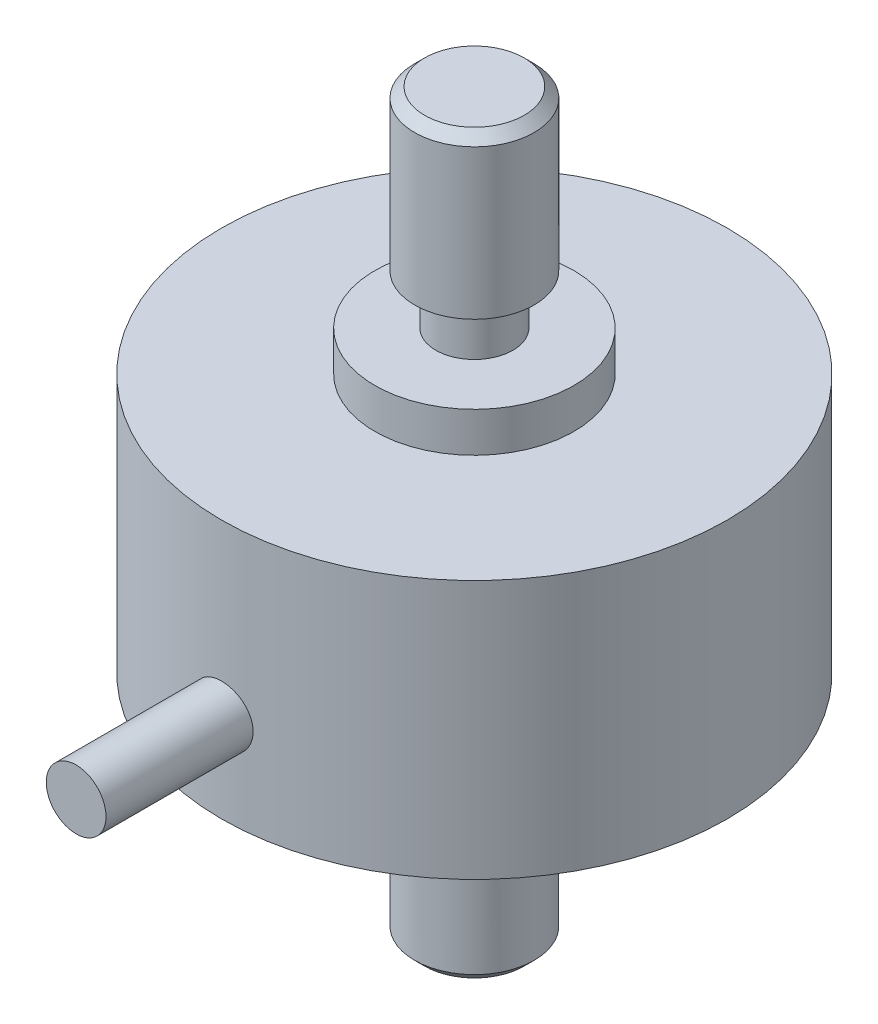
ISO-10303-21;
HEADER;
FILE_DESCRIPTION(('STEP AP214'),'2;1');
FILE_NAME('part.step','',(''),(''),'','','');
FILE_SCHEMA(('AUTOMOTIVE_DESIGN { 1 0 10303 214 1 1 1 1 }'));
ENDSEC;
DATA;
#1=APPLICATION_CONTEXT('core data for automotive mechanical design processes');
#2=APPLICATION_PROTOCOL_DEFINITION('international standard','automotive_design',2000,#1);
#3=PRODUCT_CONTEXT('',#1,'mechanical');
#4=PRODUCT('Part','Part','',(#3));
#5=PRODUCT_RELATED_PRODUCT_CATEGORY('part','',(#4));
#6=PRODUCT_DEFINITION_FORMATION('','',#4);
#7=PRODUCT_DEFINITION_CONTEXT('part definition',#1,'design');
#8=PRODUCT_DEFINITION('design','',#6,#7);
#9=PRODUCT_DEFINITION_SHAPE('','',#8);
#10=(LENGTH_UNIT() NAMED_UNIT(*) SI_UNIT(.MILLI.,.METRE.));
#11=(NAMED_UNIT(*) PLANE_ANGLE_UNIT() SI_UNIT($,.RADIAN.));
#12=(NAMED_UNIT(*) SI_UNIT($,.STERADIAN.) SOLID_ANGLE_UNIT());
#13=UNCERTAINTY_MEASURE_WITH_UNIT(LENGTH_MEASURE(1.E-05),#10,'distance_accuracy_value','');
#14=(GEOMETRIC_REPRESENTATION_CONTEXT(3) GLOBAL_UNCERTAINTY_ASSIGNED_CONTEXT((#13)) GLOBAL_UNIT_ASSIGNED_CONTEXT((#10,
#11,#12)) REPRESENTATION_CONTEXT('',''));
#15=CARTESIAN_POINT('',(0.,0.,0.));
#16=DIRECTION('',(0.,0.,1.));
#17=DIRECTION('',(1.,0.,0.));
#18=AXIS2_PLACEMENT_3D('',#15,#16,#17);
#19=CARTESIAN_POINT('',(0.,0.,0.));
#20=DIRECTION('',(0.,-1.,0.));
#21=DIRECTION('',(0.,0.,-1.));
#22=AXIS2_PLACEMENT_3D('',#19,#20,#21);
#23=CYLINDRICAL_SURFACE('',#22,12.7);
#24=CARTESIAN_POINT('',(0.,11.5,0.));
#25=DIRECTION('',(0.,-1.,0.));
#26=DIRECTION('',(0.,0.,-1.));
#27=AXIS2_PLACEMENT_3D('',#24,#25,#26);
#28=CIRCLE('',#27,12.7);
#29=CARTESIAN_POINT('',(0.,11.5,-12.7));
#30=VERTEX_POINT('',#29);
#31=EDGE_CURVE('E130',#30,#30,#28,.T.);
#32=ORIENTED_EDGE('',*,*,#31,.F.);
#33=EDGE_LOOP('',(#32));
#34=FACE_BOUND('',#33,.T.);
#35=CARTESIAN_POINT('',(0.,24.5,0.));
#36=DIRECTION('',(0.,-1.,0.));
#37=DIRECTION('',(0.,0.,-1.));
#38=AXIS2_PLACEMENT_3D('',#35,#36,#37);
#39=CIRCLE('',#38,12.7);
#40=CARTESIAN_POINT('',(0.,24.5,-12.7));
#41=VERTEX_POINT('',#40);
#42=EDGE_CURVE('E134',#41,#41,#39,.T.);
#43=ORIENTED_EDGE('',*,*,#42,.T.);
#44=EDGE_LOOP('',(#43));
#45=FACE_BOUND('',#44,.T.);
#46=CARTESIAN_POINT('',(-1.5,16.,12.6111062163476));
#47=CARTESIAN_POINT('',(-1.49999640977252,15.916060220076,12.6111073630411));
#48=CARTESIAN_POINT('',(-1.49293035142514,15.8320670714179,12.6119533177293));
#49=CARTESIAN_POINT('',(-1.46485268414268,15.6664156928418,12.6152446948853));
#50=CARTESIAN_POINT('',(-1.44382626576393,15.5847600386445,12.617691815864));
#51=CARTESIAN_POINT('',(-1.38845410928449,15.4262061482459,12.6239045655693));
#52=CARTESIAN_POINT('',(-1.35411712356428,15.3493048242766,12.6276693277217));
#53=CARTESIAN_POINT('',(-1.27311672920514,15.2023712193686,12.6360921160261));
#54=CARTESIAN_POINT('',(-1.22645552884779,15.1323377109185,12.6407499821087));
#55=CARTESIAN_POINT('',(-1.12188053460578,15.0007616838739,12.6504603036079));
#56=CARTESIAN_POINT('',(-1.06391734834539,14.9392585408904,12.6555144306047));
#57=CARTESIAN_POINT('',(-0.938489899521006,14.8268289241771,12.6654327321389));
#58=CARTESIAN_POINT('',(-0.871025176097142,14.7759029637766,12.6702968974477));
#59=CARTESIAN_POINT('',(-0.728263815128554,14.6859333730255,12.6793041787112));
#60=CARTESIAN_POINT('',(-0.652944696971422,14.6469251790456,12.683445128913));
#61=CARTESIAN_POINT('',(-0.496767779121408,14.5821253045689,12.6905210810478));
#62=CARTESIAN_POINT('',(-0.415910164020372,14.556333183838,12.6934561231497));
#63=CARTESIAN_POINT('',(-0.251353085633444,14.518814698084,12.6977777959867));
#64=CARTESIAN_POINT('',(-0.167668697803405,14.5070230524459,12.6991716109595));
#65=CARTESIAN_POINT('',(0.000501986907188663,14.4976380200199,12.7002782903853));
#66=CARTESIAN_POINT('',(0.084988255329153,14.5000441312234,12.6999912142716));
#67=CARTESIAN_POINT('',(0.251920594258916,14.5189337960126,12.6977742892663));
#68=CARTESIAN_POINT('',(0.334374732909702,14.5353471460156,12.6958526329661));
#69=CARTESIAN_POINT('',(0.495349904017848,14.5816757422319,12.6905917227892));
#70=CARTESIAN_POINT('',(0.573870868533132,14.6115912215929,12.6872524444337));
#71=CARTESIAN_POINT('',(0.724969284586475,14.6841502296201,12.6795174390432));
#72=CARTESIAN_POINT('',(0.797531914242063,14.7268243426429,12.6751191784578));
#73=CARTESIAN_POINT('',(0.934492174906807,14.8236670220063,12.6657587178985));
#74=CARTESIAN_POINT('',(0.99888947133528,14.8778360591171,12.6607964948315));
#75=CARTESIAN_POINT('',(1.11810314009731,14.9965246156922,12.6508281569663));
#76=CARTESIAN_POINT('',(1.17285864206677,15.0611052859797,12.6458219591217));
#77=CARTESIAN_POINT('',(1.27076187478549,15.1985732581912,12.6363598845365));
#78=CARTESIAN_POINT('',(1.31390957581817,15.2714605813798,12.6319040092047));
#79=CARTESIAN_POINT('',(1.38737475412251,15.423524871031,12.6240470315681));
#80=CARTESIAN_POINT('',(1.41768768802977,15.5027040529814,12.620646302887));
#81=CARTESIAN_POINT('',(1.46457061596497,15.6650777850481,12.6152921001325));
#82=CARTESIAN_POINT('',(1.48114119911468,15.7482721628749,12.6133385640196));
#83=CARTESIAN_POINT('',(1.49998912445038,15.915778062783,12.6111111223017));
#84=CARTESIAN_POINT('',(1.50235197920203,16.0000798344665,12.6108271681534));
#85=CARTESIAN_POINT('',(1.49294268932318,16.1678780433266,12.611944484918));
#86=CARTESIAN_POINT('',(1.48117081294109,16.2513744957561,12.6133457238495));
#87=CARTESIAN_POINT('',(1.44389808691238,16.4149377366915,12.6176663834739));
#88=CARTESIAN_POINT('',(1.4184383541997,16.4950140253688,12.6205812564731));
#89=CARTESIAN_POINT('',(1.35455484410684,16.6497605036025,12.6275970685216));
#90=CARTESIAN_POINT('',(1.31613065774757,16.7244305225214,12.6316980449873));
#91=CARTESIAN_POINT('',(1.22719753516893,16.8666325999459,12.640648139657));
#92=CARTESIAN_POINT('',(1.17663234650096,16.9341292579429,12.6455007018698));
#93=CARTESIAN_POINT('',(1.06493242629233,17.0597080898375,12.6553962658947));
#94=CARTESIAN_POINT('',(1.00379732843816,17.1177899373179,12.6604392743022));
#95=CARTESIAN_POINT('',(0.872320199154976,17.2231891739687,12.670178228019));
#96=CARTESIAN_POINT('',(0.801933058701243,17.2704504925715,12.6748722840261));
#97=CARTESIAN_POINT('',(0.654170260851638,17.3524797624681,12.6833564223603));
#98=CARTESIAN_POINT('',(0.576794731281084,17.3872479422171,12.6871465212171));
#99=CARTESIAN_POINT('',(0.417440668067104,17.4432106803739,12.6933872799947));
#100=CARTESIAN_POINT('',(0.335473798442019,17.4644380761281,12.6958411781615));
#101=CARTESIAN_POINT('',(0.169108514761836,17.4928236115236,12.6991464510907));
#102=CARTESIAN_POINT('',(0.0847101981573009,17.4999823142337,12.6999978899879));
#103=CARTESIAN_POINT('',(-0.0835737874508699,17.5000175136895,12.7000020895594));
#104=CARTESIAN_POINT('',(-0.16745945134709,17.4929806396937,12.6991651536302));
#105=CARTESIAN_POINT('',(-0.332847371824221,17.4650073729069,12.6959070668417));
#106=CARTESIAN_POINT('',(-0.414349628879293,17.444070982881,12.6934859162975));
#107=CARTESIAN_POINT('',(-0.572648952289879,17.3889192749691,12.6873303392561));
#108=CARTESIAN_POINT('',(-0.649447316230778,17.3547076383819,12.6835962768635));
#109=CARTESIAN_POINT('',(-0.796226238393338,17.273985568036,12.6752291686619));
#110=CARTESIAN_POINT('',(-0.866206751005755,17.2274750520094,12.6705961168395));
#111=CARTESIAN_POINT('',(-0.997806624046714,17.1231534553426,12.6609149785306));
#112=CARTESIAN_POINT('',(-1.05937467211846,17.0652778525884,12.6558646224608));
#113=CARTESIAN_POINT('',(-1.17195987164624,16.9400017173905,12.645936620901));
#114=CARTESIAN_POINT('',(-1.22297451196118,16.8725989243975,12.6410590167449));
#115=CARTESIAN_POINT('',(-1.3131529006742,16.7299171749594,12.6320107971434));
#116=CARTESIAN_POINT('',(-1.35227506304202,16.6546117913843,12.6278426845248));
#117=CARTESIAN_POINT('',(-1.41726371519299,16.4984948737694,12.620714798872));
#118=CARTESIAN_POINT('',(-1.44314478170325,16.4176895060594,12.6177536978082));
#119=CARTESIAN_POINT('',(-1.47464317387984,16.2803781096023,12.614102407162));
#120=CARTESIAN_POINT('',(-1.48413851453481,16.2247419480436,12.6129843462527));
#121=CARTESIAN_POINT('',(-1.4968181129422,16.1127452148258,12.6114858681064));
#122=CARTESIAN_POINT('',(-1.50000241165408,16.0563846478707,12.6111054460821));
#123=CARTESIAN_POINT('',(-1.5,16.,12.6111062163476));
#124=B_SPLINE_CURVE_WITH_KNOTS('',3,(#46,#47,#48,#49,#50,#51,#52,#53,#54,#55,#56,#57,#58,#59,
#60,#61,#62,#63,#64,#65,#66,#67,#68,#69,#70,#71,#72,#73,#74,#75,#76,#77,#78,#79,#80,#81,#82,#83,
#84,#85,#86,#87,#88,#89,#90,#91,#92,#93,#94,#95,#96,#97,#98,#99,#100,#101,#102,#103,#104,#105,
#106,#107,#108,#109,#110,#111,#112,#113,#114,#115,#116,#117,#118,#119,#120,#121,#122,#123),
.UNSPECIFIED.,.T.,.F.,(4,2,2,2,2,2,2,2,2,2,2,2,2,2,2,2,2,2,2,2,2,2,2,2,2,2,2,2,2,2,2,2,2,2,2,2,
2,2,4),(0.,0.251613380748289,0.503494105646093,0.75520948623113,1.00687979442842,
1.25967566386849,1.51248379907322,1.76603647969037,2.0195807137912,2.27193803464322,
2.52428643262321,2.77537745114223,3.02647280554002,3.27817496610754,3.5298874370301,
3.78313609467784,4.03638540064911,4.28972427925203,4.5430522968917,4.79485406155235,
5.04665104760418,5.29769585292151,5.54874857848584,5.80098773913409,6.05323564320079,
6.30676248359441,6.56028468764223,6.8131897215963,7.06608463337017,7.31744090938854,
7.56879713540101,7.82008370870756,8.07137196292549,8.32413038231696,8.57694887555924,
8.83064152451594,9.08405428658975,9.25307097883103,9.42208657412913),.UNSPECIFIED.);
#125=CARTESIAN_POINT('',(-1.5,16.,12.6111062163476));
#126=VERTEX_POINT('',#125);
#127=EDGE_CURVE('E61',#126,#126,#124,.T.);
#128=ORIENTED_EDGE('',*,*,#127,.F.);
#129=EDGE_LOOP('',(#128));
#130=FACE_BOUND('',#129,.T.);
#131=ADVANCED_FACE('F41',(#34,#45,#130),#23,.T.);
#132=CARTESIAN_POINT('',(0.,37.,0.));
#133=DIRECTION('',(0.,-1.,0.));
#134=DIRECTION('',(0.,0.,-1.));
#135=AXIS2_PLACEMENT_3D('',#132,#133,#134);
#136=PLANE('',#135);
#137=CARTESIAN_POINT('',(0.,37.,0.));
#138=DIRECTION('',(0.,-1.,0.));
#139=DIRECTION('',(0.,0.,-1.));
#140=AXIS2_PLACEMENT_3D('',#137,#138,#139);
#141=CIRCLE('',#140,2.5);
#142=CARTESIAN_POINT('',(0.,37.,-2.5));
#143=VERTEX_POINT('',#142);
#144=EDGE_CURVE('E10',#143,#143,#141,.F.);
#145=ORIENTED_EDGE('',*,*,#144,.T.);
#146=EDGE_LOOP('',(#145));
#147=FACE_BOUND('',#146,.T.);
#148=ADVANCED_FACE('F116',(#147),#136,.F.);
#149=CARTESIAN_POINT('',(0.,0.,0.));
#150=DIRECTION('',(0.,-1.,0.));
#151=DIRECTION('',(0.,0.,-1.));
#152=AXIS2_PLACEMENT_3D('',#149,#150,#151);
#153=CYLINDRICAL_SURFACE('',#152,3.);
#154=CARTESIAN_POINT('',(0.,36.5,0.));
#155=DIRECTION('',(0.,-1.,0.));
#156=DIRECTION('',(0.,0.,-1.));
#157=AXIS2_PLACEMENT_3D('',#154,#155,#156);
#158=CIRCLE('',#157,3.);
#159=CARTESIAN_POINT('',(0.,36.5,-3.));
#160=VERTEX_POINT('',#159);
#161=EDGE_CURVE('E47',#160,#160,#158,.T.);
#162=ORIENTED_EDGE('',*,*,#161,.T.);
#163=EDGE_LOOP('',(#162));
#164=FACE_BOUND('',#163,.T.);
#165=CARTESIAN_POINT('',(0.,29.,0.));
#166=DIRECTION('',(0.,-1.,0.));
#167=DIRECTION('',(0.,0.,-1.));
#168=AXIS2_PLACEMENT_3D('',#165,#166,#167);
#169=CIRCLE('',#168,3.);
#170=CARTESIAN_POINT('',(0.,29.,-3.));
#171=VERTEX_POINT('',#170);
#172=EDGE_CURVE('E69',#171,#171,#169,.T.);
#173=ORIENTED_EDGE('',*,*,#172,.F.);
#174=EDGE_LOOP('',(#173));
#175=FACE_BOUND('',#174,.T.);
#176=ADVANCED_FACE('F125',(#164,#175),#153,.T.);
#177=CARTESIAN_POINT('',(-3.,29.,0.));
#178=DIRECTION('',(0.,1.,0.));
#179=DIRECTION('',(0.,0.,1.));
#180=AXIS2_PLACEMENT_3D('',#177,#178,#179);
#181=PLANE('',#180);
#182=CARTESIAN_POINT('',(0.,29.,0.));
#183=DIRECTION('',(0.,-1.,0.));
#184=DIRECTION('',(0.,0.,-1.));
#185=AXIS2_PLACEMENT_3D('',#182,#183,#184);
#186=CIRCLE('',#185,1.93637753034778);
#187=CARTESIAN_POINT('',(0.,29.,-1.93637753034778));
#188=VERTEX_POINT('',#187);
#189=EDGE_CURVE('E150',#188,#188,#186,.T.);
#190=ORIENTED_EDGE('',*,*,#189,.F.);
#191=EDGE_LOOP('',(#190));
#192=FACE_BOUND('',#191,.T.);
#193=ORIENTED_EDGE('',*,*,#172,.T.);
#194=EDGE_LOOP('',(#193));
#195=FACE_BOUND('',#194,.T.);
#196=ADVANCED_FACE('F152',(#192,#195),#181,.F.);
#197=CARTESIAN_POINT('',(0.,0.,0.));
#198=DIRECTION('',(0.,-1.,0.));
#199=DIRECTION('',(0.,0.,-1.));
#200=AXIS2_PLACEMENT_3D('',#197,#198,#199);
#201=CYLINDRICAL_SURFACE('',#200,1.93637753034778);
#202=CARTESIAN_POINT('',(0.,26.5,0.));
#203=DIRECTION('',(0.,-1.,0.));
#204=DIRECTION('',(0.,0.,-1.));
#205=AXIS2_PLACEMENT_3D('',#202,#203,#204);
#206=CIRCLE('',#205,1.93637753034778);
#207=CARTESIAN_POINT('',(0.,26.5,-1.93637753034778));
#208=VERTEX_POINT('',#207);
#209=EDGE_CURVE('E144',#208,#208,#206,.T.);
#210=ORIENTED_EDGE('',*,*,#209,.F.);
#211=EDGE_LOOP('',(#210));
#212=FACE_BOUND('',#211,.T.);
#213=ORIENTED_EDGE('',*,*,#189,.T.);
#214=EDGE_LOOP('',(#213));
#215=FACE_BOUND('',#214,.T.);
#216=ADVANCED_FACE('F161',(#212,#215),#201,.T.);
#217=CARTESIAN_POINT('',(-1.93637753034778,26.5,0.));
#218=DIRECTION('',(0.,-1.,0.));
#219=DIRECTION('',(0.,0.,-1.));
#220=AXIS2_PLACEMENT_3D('',#217,#218,#219);
#221=PLANE('',#220);
#222=CARTESIAN_POINT('',(0.,26.5,0.));
#223=DIRECTION('',(0.,-1.,0.));
#224=DIRECTION('',(0.,0.,-1.));
#225=AXIS2_PLACEMENT_3D('',#222,#223,#224);
#226=CIRCLE('',#225,5.);
#227=CARTESIAN_POINT('',(0.,26.5,-5.));
#228=VERTEX_POINT('',#227);
#229=EDGE_CURVE('E140',#228,#228,#226,.T.);
#230=ORIENTED_EDGE('',*,*,#229,.F.);
#231=EDGE_LOOP('',(#230));
#232=FACE_BOUND('',#231,.T.);
#233=ORIENTED_EDGE('',*,*,#209,.T.);
#234=EDGE_LOOP('',(#233));
#235=FACE_BOUND('',#234,.T.);
#236=ADVANCED_FACE('F234',(#232,#235),#221,.F.);
#237=CARTESIAN_POINT('',(0.,0.,0.));
#238=DIRECTION('',(0.,-1.,0.));
#239=DIRECTION('',(0.,0.,-1.));
#240=AXIS2_PLACEMENT_3D('',#237,#238,#239);
#241=CYLINDRICAL_SURFACE('',#240,5.);
#242=CARTESIAN_POINT('',(0.,24.5,0.));
#243=DIRECTION('',(0.,-1.,0.));
#244=DIRECTION('',(0.,0.,-1.));
#245=AXIS2_PLACEMENT_3D('',#242,#243,#244);
#246=CIRCLE('',#245,5.);
#247=CARTESIAN_POINT('',(0.,24.5,-5.));
#248=VERTEX_POINT('',#247);
#249=EDGE_CURVE('E133',#248,#248,#246,.T.);
#250=ORIENTED_EDGE('',*,*,#249,.F.);
#251=EDGE_LOOP('',(#250));
#252=FACE_BOUND('',#251,.T.);
#253=ORIENTED_EDGE('',*,*,#229,.T.);
#254=EDGE_LOOP('',(#253));
#255=FACE_BOUND('',#254,.T.);
#256=ADVANCED_FACE('F115',(#252,#255),#241,.T.);
#257=CARTESIAN_POINT('',(-5.,24.5,0.));
#258=DIRECTION('',(0.,-1.,0.));
#259=DIRECTION('',(0.,0.,-1.));
#260=AXIS2_PLACEMENT_3D('',#257,#258,#259);
#261=PLANE('',#260);
#262=ORIENTED_EDGE('',*,*,#42,.F.);
#263=EDGE_LOOP('',(#262));
#264=FACE_BOUND('',#263,.T.);
#265=ORIENTED_EDGE('',*,*,#249,.T.);
#266=EDGE_LOOP('',(#265));
#267=FACE_BOUND('',#266,.T.);
#268=ADVANCED_FACE('F110',(#264,#267),#261,.F.);
#269=CARTESIAN_POINT('',(-12.7,11.5,0.));
#270=DIRECTION('',(0.,1.,0.));
#271=DIRECTION('',(0.,0.,1.));
#272=AXIS2_PLACEMENT_3D('',#269,#270,#271);
#273=PLANE('',#272);
#274=CARTESIAN_POINT('',(0.,11.5,0.));
#275=DIRECTION('',(0.,-1.,0.));
#276=DIRECTION('',(0.,0.,-1.));
#277=AXIS2_PLACEMENT_3D('',#274,#275,#276);
#278=CIRCLE('',#277,3.3);
#279=CARTESIAN_POINT('',(0.,11.5,-3.3));
#280=VERTEX_POINT('',#279);
#281=EDGE_CURVE('E137',#280,#280,#278,.T.);
#282=ORIENTED_EDGE('',*,*,#281,.F.);
#283=EDGE_LOOP('',(#282));
#284=FACE_BOUND('',#283,.T.);
#285=ORIENTED_EDGE('',*,*,#31,.T.);
#286=EDGE_LOOP('',(#285));
#287=FACE_BOUND('',#286,.T.);
#288=ADVANCED_FACE('F102',(#284,#287),#273,.F.);
#289=CARTESIAN_POINT('',(0.,0.,0.));
#290=DIRECTION('',(0.,-1.,0.));
#291=DIRECTION('',(0.,0.,-1.));
#292=AXIS2_PLACEMENT_3D('',#289,#290,#291);
#293=CYLINDRICAL_SURFACE('',#292,3.3);
#294=CARTESIAN_POINT('',(0.,10.5,0.));
#295=DIRECTION('',(0.,-1.,0.));
#296=DIRECTION('',(0.,0.,-1.));
#297=AXIS2_PLACEMENT_3D('',#294,#295,#296);
#298=CIRCLE('',#297,3.3);
#299=CARTESIAN_POINT('',(0.,10.5,-3.3));
#300=VERTEX_POINT('',#299);
#301=EDGE_CURVE('E194',#300,#300,#298,.T.);
#302=ORIENTED_EDGE('',*,*,#301,.F.);
#303=EDGE_LOOP('',(#302));
#304=FACE_BOUND('',#303,.T.);
#305=ORIENTED_EDGE('',*,*,#281,.T.);
#306=EDGE_LOOP('',(#305));
#307=FACE_BOUND('',#306,.T.);
#308=ADVANCED_FACE('F101',(#304,#307),#293,.T.);
#309=CARTESIAN_POINT('',(-3.3,10.5,0.));
#310=DIRECTION('',(0.,1.,0.));
#311=DIRECTION('',(0.,0.,1.));
#312=AXIS2_PLACEMENT_3D('',#309,#310,#311);
#313=PLANE('',#312);
#314=CARTESIAN_POINT('',(0.,10.5,0.));
#315=DIRECTION('',(0.,-1.,0.));
#316=DIRECTION('',(0.,0.,-1.));
#317=AXIS2_PLACEMENT_3D('',#314,#315,#316);
#318=CIRCLE('',#317,2.3092706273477);
#319=CARTESIAN_POINT('',(0.,10.5,-2.3092706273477));
#320=VERTEX_POINT('',#319);
#321=EDGE_CURVE('E190',#320,#320,#318,.T.);
#322=ORIENTED_EDGE('',*,*,#321,.F.);
#323=EDGE_LOOP('',(#322));
#324=FACE_BOUND('',#323,.T.);
#325=ORIENTED_EDGE('',*,*,#301,.T.);
#326=EDGE_LOOP('',(#325));
#327=FACE_BOUND('',#326,.T.);
#328=ADVANCED_FACE('F100',(#324,#327),#313,.F.);
#329=CARTESIAN_POINT('',(0.,0.,0.));
#330=DIRECTION('',(0.,-1.,0.));
#331=DIRECTION('',(0.,0.,-1.));
#332=AXIS2_PLACEMENT_3D('',#329,#330,#331);
#333=CYLINDRICAL_SURFACE('',#332,2.3092706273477);
#334=CARTESIAN_POINT('',(0.,8.,0.));
#335=DIRECTION('',(0.,-1.,0.));
#336=DIRECTION('',(0.,0.,-1.));
#337=AXIS2_PLACEMENT_3D('',#334,#335,#336);
#338=CIRCLE('',#337,2.3092706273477);
#339=CARTESIAN_POINT('',(0.,8.,-2.3092706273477));
#340=VERTEX_POINT('',#339);
#341=EDGE_CURVE('E184',#340,#340,#338,.T.);
#342=ORIENTED_EDGE('',*,*,#341,.F.);
#343=EDGE_LOOP('',(#342));
#344=FACE_BOUND('',#343,.T.);
#345=ORIENTED_EDGE('',*,*,#321,.T.);
#346=EDGE_LOOP('',(#345));
#347=FACE_BOUND('',#346,.T.);
#348=ADVANCED_FACE('F91',(#344,#347),#333,.T.);
#349=CARTESIAN_POINT('',(-2.3092706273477,8.,0.));
#350=DIRECTION('',(0.,-1.,0.));
#351=DIRECTION('',(0.,0.,-1.));
#352=AXIS2_PLACEMENT_3D('',#349,#350,#351);
#353=PLANE('',#352);
#354=CARTESIAN_POINT('',(0.,8.,0.));
#355=DIRECTION('',(0.,-1.,0.));
#356=DIRECTION('',(0.,0.,-1.));
#357=AXIS2_PLACEMENT_3D('',#354,#355,#356);
#358=CIRCLE('',#357,3.);
#359=CARTESIAN_POINT('',(0.,8.,-3.));
#360=VERTEX_POINT('',#359);
#361=EDGE_CURVE('E181',#360,#360,#358,.T.);
#362=ORIENTED_EDGE('',*,*,#361,.F.);
#363=EDGE_LOOP('',(#362));
#364=FACE_BOUND('',#363,.T.);
#365=ORIENTED_EDGE('',*,*,#341,.T.);
#366=EDGE_LOOP('',(#365));
#367=FACE_BOUND('',#366,.T.);
#368=ADVANCED_FACE('F90',(#364,#367),#353,.F.);
#369=CARTESIAN_POINT('',(0.,0.,0.));
#370=DIRECTION('',(0.,-1.,0.));
#371=DIRECTION('',(0.,0.,-1.));
#372=AXIS2_PLACEMENT_3D('',#369,#370,#371);
#373=CYLINDRICAL_SURFACE('',#372,3.);
#374=CARTESIAN_POINT('',(0.,0.500000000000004,0.));
#375=DIRECTION('',(0.,1.,0.));
#376=DIRECTION('',(0.,0.,1.));
#377=AXIS2_PLACEMENT_3D('',#374,#375,#376);
#378=CIRCLE('',#377,3.);
#379=CARTESIAN_POINT('',(0.,0.500000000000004,3.));
#380=VERTEX_POINT('',#379);
#381=EDGE_CURVE('E52',#380,#380,#378,.T.);
#382=ORIENTED_EDGE('',*,*,#381,.T.);
#383=EDGE_LOOP('',(#382));
#384=FACE_BOUND('',#383,.T.);
#385=ORIENTED_EDGE('',*,*,#361,.T.);
#386=EDGE_LOOP('',(#385));
#387=FACE_BOUND('',#386,.T.);
#388=ADVANCED_FACE('F84',(#384,#387),#373,.T.);
#389=CARTESIAN_POINT('',(-3.,0.,0.));
#390=DIRECTION('',(0.,1.,0.));
#391=DIRECTION('',(0.,0.,1.));
#392=AXIS2_PLACEMENT_3D('',#389,#390,#391);
#393=PLANE('',#392);
#394=CARTESIAN_POINT('',(0.,0.,0.));
#395=DIRECTION('',(0.,1.,0.));
#396=DIRECTION('',(0.,0.,1.));
#397=AXIS2_PLACEMENT_3D('',#394,#395,#396);
#398=CIRCLE('',#397,2.5);
#399=CARTESIAN_POINT('',(0.,0.,2.5));
#400=VERTEX_POINT('',#399);
#401=EDGE_CURVE('E60',#400,#400,#398,.F.);
#402=ORIENTED_EDGE('',*,*,#401,.T.);
#403=EDGE_LOOP('',(#402));
#404=FACE_BOUND('',#403,.T.);
#405=ADVANCED_FACE('F81',(#404),#393,.F.);
#406=CARTESIAN_POINT('',(0.,16.,20.));
#407=DIRECTION('',(0.,0.,-1.));
#408=DIRECTION('',(-1.,0.,0.));
#409=AXIS2_PLACEMENT_3D('',#406,#407,#408);
#410=CYLINDRICAL_SURFACE('',#409,1.5);
#411=CARTESIAN_POINT('',(0.,16.,20.));
#412=DIRECTION('',(0.,0.,1.));
#413=DIRECTION('',(1.,0.,0.));
#414=AXIS2_PLACEMENT_3D('',#411,#412,#413);
#415=CIRCLE('',#414,1.5);
#416=CARTESIAN_POINT('',(1.5,16.,20.));
#417=VERTEX_POINT('',#416);
#418=EDGE_CURVE('E183',#417,#417,#415,.T.);
#419=ORIENTED_EDGE('',*,*,#418,.F.);
#420=EDGE_LOOP('',(#419));
#421=FACE_BOUND('',#420,.T.);
#422=ORIENTED_EDGE('',*,*,#127,.T.);
#423=EDGE_LOOP('',(#422));
#424=FACE_BOUND('',#423,.T.);
#425=ADVANCED_FACE('F73',(#421,#424),#410,.T.);
#426=CARTESIAN_POINT('',(0.,16.,20.));
#427=DIRECTION('',(0.,0.,1.));
#428=DIRECTION('',(1.,0.,0.));
#429=AXIS2_PLACEMENT_3D('',#426,#427,#428);
#430=PLANE('',#429);
#431=ORIENTED_EDGE('',*,*,#418,.T.);
#432=EDGE_LOOP('',(#431));
#433=FACE_BOUND('',#432,.T.);
#434=ADVANCED_FACE('F77',(#433),#430,.T.);
#435=CARTESIAN_POINT('',(0.,0.,0.));
#436=DIRECTION('',(0.,1.,0.));
#437=DIRECTION('',(0.,0.,1.));
#438=AXIS2_PLACEMENT_3D('',#435,#436,#437);
#439=CONICAL_SURFACE('',#438,2.5,0.785398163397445);
#440=ORIENTED_EDGE('',*,*,#381,.F.);
#441=EDGE_LOOP('',(#440));
#442=FACE_BOUND('',#441,.T.);
#443=ORIENTED_EDGE('',*,*,#401,.F.);
#444=EDGE_LOOP('',(#443));
#445=FACE_BOUND('',#444,.T.);
#446=ADVANCED_FACE('F167',(#442,#445),#439,.T.);
#447=CARTESIAN_POINT('',(0.,36.5,0.));
#448=DIRECTION('',(0.,-1.,0.));
#449=DIRECTION('',(0.,0.,-1.));
#450=AXIS2_PLACEMENT_3D('',#447,#448,#449);
#451=CONICAL_SURFACE('',#450,3.,0.785398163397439);
#452=ORIENTED_EDGE('',*,*,#144,.F.);
#453=EDGE_LOOP('',(#452));
#454=FACE_BOUND('',#453,.T.);
#455=ORIENTED_EDGE('',*,*,#161,.F.);
#456=EDGE_LOOP('',(#455));
#457=FACE_BOUND('',#456,.T.);
#458=ADVANCED_FACE('F42',(#454,#457),#451,.T.);
#459=CLOSED_SHELL('',(#131,#148,#176,#196,#216,#236,#256,#268,#288,#308,#328,#348,#368,#388,
#405,#425,#434,#446,#458));
#460=MANIFOLD_SOLID_BREP('B2',#459);
#461=ADVANCED_BREP_SHAPE_REPRESENTATION('',(#18,#460),#14);
#462=SHAPE_DEFINITION_REPRESENTATION(#9,#461);
ENDSEC;
END-ISO-10303-21;
